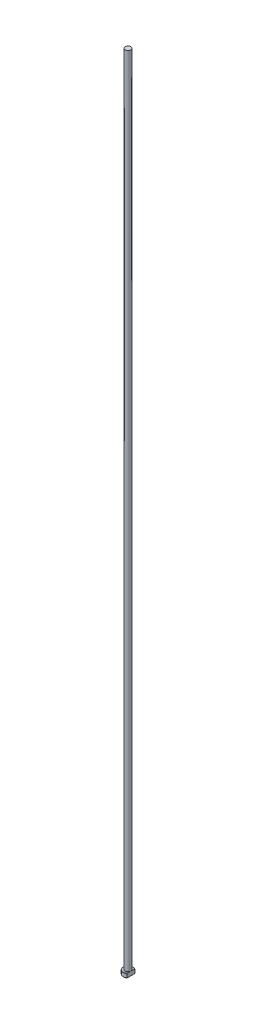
from build123d import *
from build123d.topology import SkipClean

# Parameters (mm, degrees)
CHAMFER1_SIZE = 0.2
FILLET1_R     = 0.2
KEY_DEPTH     = 1001.035999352


with BuildPart() as part:
    # Sketch1 → Revolve1 (revolve)
    with BuildSketch(Plane.XY, mode=Mode.PRIVATE) as revolve1_sk:
        Polygon((0, 0), (-6, 0), (-6, 5), (-3.5, 5), (-3.5, 1000), (0, 1000), align=None)
    revolve(revolve1_sk.sketch.rotate(Axis((0, 259.958771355, 0), (0, -1, 0)), 270), axis=Axis((0, 259.958771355, 0), (0, -1, 0)))

    # Chamfer1
    chamfer1_edges = [part.edges().sort_by_distance(p)[0] for p in [
        (0, 5, -6),
        (0, 0, -6),
    ]]
    chamfer(chamfer1_edges, length=CHAMFER1_SIZE)

    # Fillet1
    fillet1_edges = [part.edges().sort_by_distance(p)[0] for p in [
        (0, 5, -3.5),
    ]]
    fillet(fillet1_edges, radius=FILLET1_R)

    # Sketch2 → KEY (cut, through all)
    with SkipClean():  # the faces are left unmerged after this step: merging them gives an invalid solid
        with BuildSketch(Plane(origin=(0, 0, 0), x_dir=(1, 0, 0), z_dir=(0, 1, 0))):
            with BuildLine():
                Line((3.5, 4.873397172), (3.5, -4.873397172))
                ThreePointArc((3.5, -4.873397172), (6, 0), (3.5, 4.873397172))
            make_face()
        extrude(amount=KEY_DEPTH, mode=Mode.SUBTRACT)


solid = part.part
